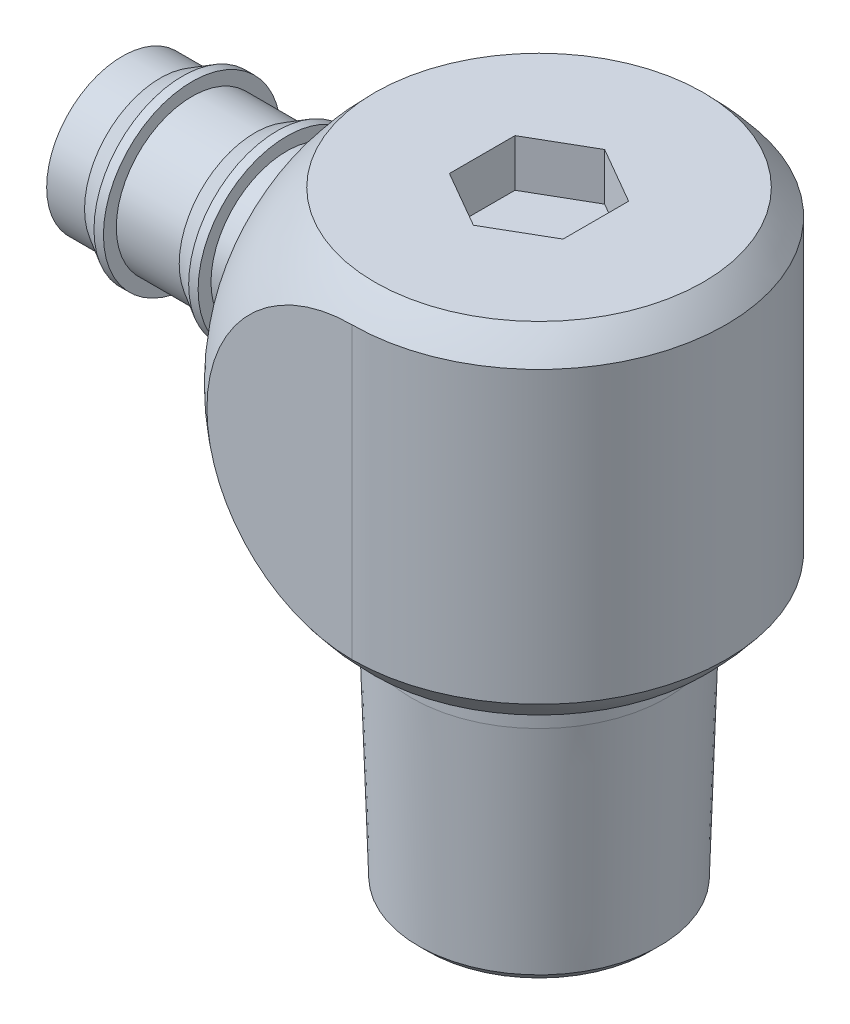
from build123d import *

# Parameters (mm, degrees)
CUT_EXTRUDE1_DEPTH      = 52.173818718
CUT_EXTRUDE1_DEPTH_BACK = 52.173818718
SKETCH3_OUTSIDE_W       = 55.436
SKETCH3_OUTSIDE_H       = 55.436
CUT_EXTRUDE2_DEPTH      = 49.199771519
CUT_EXTRUDE2_DEPTH_BACK = 49.199771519
SKETCH4_OUTSIDE_W       = 45.272
SKETCH4_OUTSIDE_H       = 53.592
SKETCH4_OUTSIDE_W_2     = 50.8
SKETCH4_OUTSIDE_H_2     = 28.575
FILLET1_R               = 1.190625
CUT_EXTRUDE3_START      = -34.925
SKETCH10_R              = 5.08
CUT_EXTRUDE3_DEPTH      = 34.925
CUT_EXTRUDE4_DEPTH      = 3.96875
SKETCH13_R              = 7.9375
CUT_EXTRUDE5_DEPTH      = 44.77258


with BuildPart() as part:
    # Sketch1 → Revolve1 (revolve)
    with BuildSketch(Plane.XY):
        with BuildLine():
            Line((0, 42.79265), (0, 3.10515))
            ThreePointArc((0, 3.10515), (19.84375, 22.9489), (0, 42.79265))
        make_face()
    revolve(axis=Axis((0, 0, 0), (0, 1, 0)))

    # Sketch3 outside → Cut-Extrude1 (cut, two sides: drawn at the far end of the back side and taken through both)
    with BuildSketch(Plane(origin=(0, 0, 0), x_dir=(1, 0, 0), z_dir=(0, 1, 0)).offset(-CUT_EXTRUDE1_DEPTH_BACK)):
        Rectangle(SKETCH3_OUTSIDE_W, SKETCH3_OUTSIDE_H)
        with BuildLine():
            Line((0, -15.6845), (-15.6845, -15.6845))
            Line((-15.6845, -15.6845), (-15.6845, 15.6845))
            Line((-15.6845, 15.6845), (0, 15.6845))
            ThreePointArc((0, 15.6845), (15.6845, 0), (0, -15.6845))
        make_face(mode=Mode.SUBTRACT)
    extrude(amount=CUT_EXTRUDE1_DEPTH + CUT_EXTRUDE1_DEPTH_BACK, mode=Mode.SUBTRACT)

    # Sketch4 outside → Cut-Extrude2 (cut, two sides: drawn at the far end of the back side and taken through both)
    with BuildSketch(Plane.XY.offset(-CUT_EXTRUDE2_DEPTH_BACK)):
        with Locations((0, 22.949)):
            Rectangle(SKETCH4_OUTSIDE_W, SKETCH4_OUTSIDE_H)
        with Locations((0, 22.9489)):
            Rectangle(SKETCH4_OUTSIDE_W_2, SKETCH4_OUTSIDE_H_2, mode=Mode.SUBTRACT)
    extrude(amount=CUT_EXTRUDE2_DEPTH + CUT_EXTRUDE2_DEPTH_BACK, mode=Mode.SUBTRACT)

    # Sketch9 → Revolve2 (revolve)
    with BuildSketch(Plane(origin=(0, 22.9489, 0), x_dir=(1, 0, 0), z_dir=(0, 1, 0)), mode=Mode.PRIVATE) as revolve2_sk:
        Polygon((-34.925, 0), (-34.925, 6.35), (-31.75, 6.35), (-29.880251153, 7.4295), (-29.086501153, 7.4295), (-29.086501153, 6.35), (-23.8125, 6.35), (-21.942751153, 7.4295), (-21.149001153, 7.4295), (-21.149001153, 6.35), (0, 6.35), (0, 0), align=None)
    revolve(revolve2_sk.sketch.rotate(Axis((0, 22.9489, 0), (1, 0, 0)), 180), axis=Axis((0, 22.9489, 0), (1, 0, 0)))

    # Fillet1
    fillet1_edges = [part.edges().sort_by_distance(p)[0] for p in [
        (-15.6845, 22.9489, -6.35),
    ]]
    fillet(fillet1_edges, radius=FILLET1_R)

    # Sketch10 → Cut-Extrude3 (cut)
    with BuildSketch(Plane.ZY.offset(34.925).offset(CUT_EXTRUDE3_START)):
        with Locations((0, 22.9489)):
            Circle(SKETCH10_R)
    extrude(amount=CUT_EXTRUDE3_DEPTH, mode=Mode.SUBTRACT)

    # Sketch11 → Revolve3 (revolve)
    with BuildSketch(Plane.XY, mode=Mode.PRIVATE) as revolve3_sk:
        Polygon((0, 8.6614), (10.668, 8.6614), (10.668, 5.4864), (10.096503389, -12.8016), (9.334503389, -13.5636), (0, -13.5636), align=None)
    revolve(revolve3_sk.sketch.rotate(Axis((0, -24.940075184, 0), (0, -1, 0)), 180), axis=Axis((0, -24.940075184, 0), (0, -1, 0)))

    # Sketch12 → Cut-Extrude4 (cut)
    with BuildSketch(Plane(origin=(0, 37.2364, 0), x_dir=(1, 0, 0), z_dir=(0, 1, 0))):
        Polygon((0, -5.499261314), (4.7625, -2.749630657), (4.7625, 2.749630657), (0, 5.499261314), (-4.7625, 2.749630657), (-4.7625, -2.749630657), align=None)
    extrude(amount=-CUT_EXTRUDE4_DEPTH, mode=Mode.SUBTRACT)

    # Sketch13 → Cut-Extrude5 (cut)
    with BuildSketch(Plane.XZ.offset(13.5636)):
        Circle(SKETCH13_R)
    extrude(amount=-CUT_EXTRUDE5_DEPTH, mode=Mode.SUBTRACT)


solid = part.part
